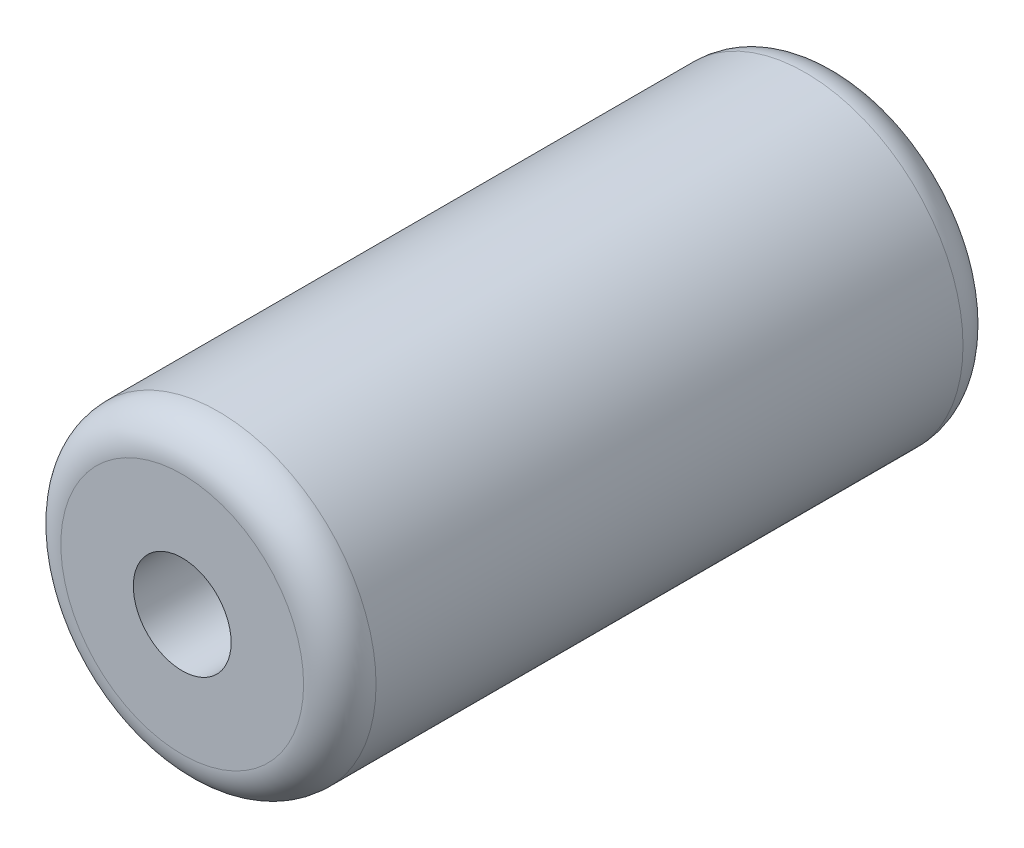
from build123d import *

# Parameters (mm, degrees)
ESQUISSE1_R             = 43.5
EXTRUSION1_DEPTH        = 182
CONG_1_R                = 10
ESQUISSE2_R             = 13.5
ENL_V_MAT_EXTRU_1_DEPTH = 193.115850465


with BuildPart() as part:
    # Esquisse1 → Extrusion1 (new body)
    with BuildSketch(Plane.XY):
        Circle(ESQUISSE1_R)
    extrude(amount=EXTRUSION1_DEPTH)

    # Cong_1
    cong_1_edges = [part.edges().sort_by_distance(p)[0] for p in [
        (-43.5, 0, 0),
        (-43.5, 0, 182),
    ]]
    fillet(cong_1_edges, radius=CONG_1_R)

    # Esquisse2 → Enl_v. mat.-Extru.1 (cut, through all)
    with BuildSketch(Plane.XY.offset(182)):
        Circle(ESQUISSE2_R)
    extrude(amount=-ENL_V_MAT_EXTRU_1_DEPTH, mode=Mode.SUBTRACT)


solid = part.part
